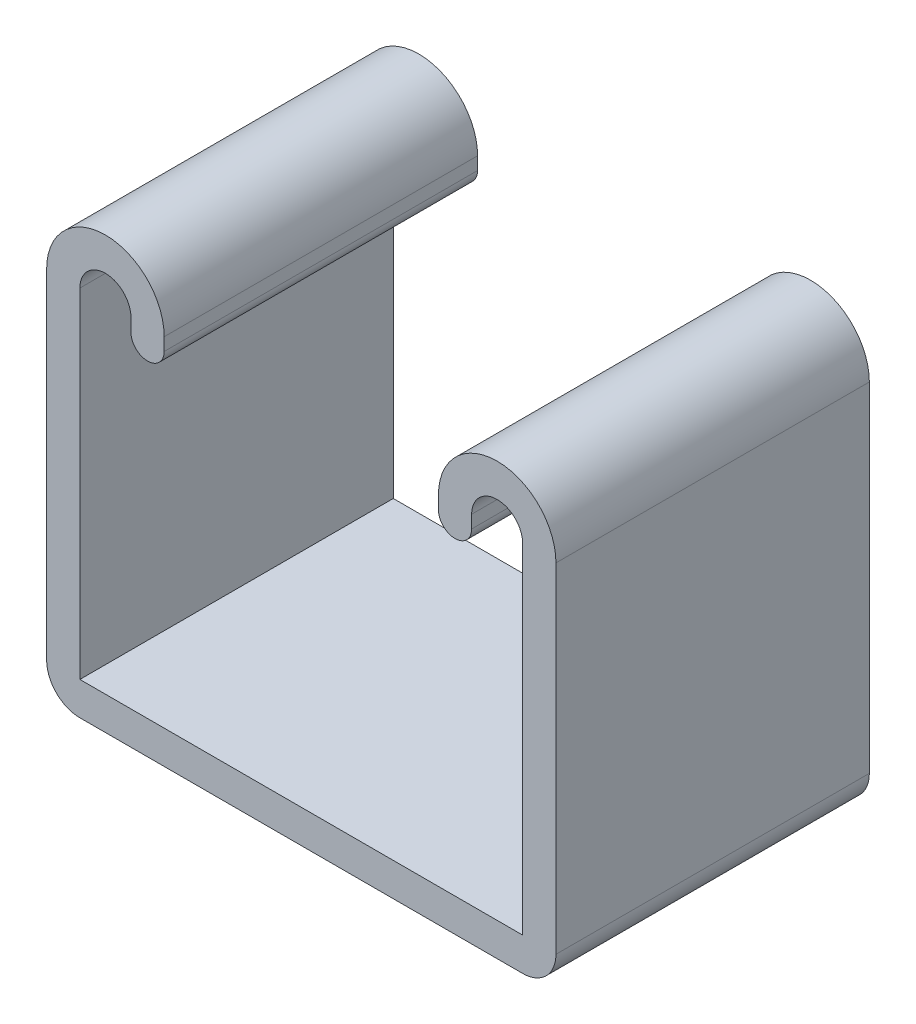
ISO-10303-21;
HEADER;
FILE_DESCRIPTION(('STEP AP214'),'2;1');
FILE_NAME('part.step','',(''),(''),'','','');
FILE_SCHEMA(('AUTOMOTIVE_DESIGN { 1 0 10303 214 1 1 1 1 }'));
ENDSEC;
DATA;
#1=APPLICATION_CONTEXT('core data for automotive mechanical design processes');
#2=APPLICATION_PROTOCOL_DEFINITION('international standard','automotive_design',2000,#1);
#3=PRODUCT_CONTEXT('',#1,'mechanical');
#4=PRODUCT('Part','Part','',(#3));
#5=PRODUCT_RELATED_PRODUCT_CATEGORY('part','',(#4));
#6=PRODUCT_DEFINITION_FORMATION('','',#4);
#7=PRODUCT_DEFINITION_CONTEXT('part definition',#1,'design');
#8=PRODUCT_DEFINITION('design','',#6,#7);
#9=PRODUCT_DEFINITION_SHAPE('','',#8);
#10=(LENGTH_UNIT() NAMED_UNIT(*) SI_UNIT(.MILLI.,.METRE.));
#11=(NAMED_UNIT(*) PLANE_ANGLE_UNIT() SI_UNIT($,.RADIAN.));
#12=(NAMED_UNIT(*) SI_UNIT($,.STERADIAN.) SOLID_ANGLE_UNIT());
#13=UNCERTAINTY_MEASURE_WITH_UNIT(LENGTH_MEASURE(1.E-05),#10,'distance_accuracy_value','');
#14=(GEOMETRIC_REPRESENTATION_CONTEXT(3) GLOBAL_UNCERTAINTY_ASSIGNED_CONTEXT((#13)) GLOBAL_UNIT_ASSIGNED_CONTEXT((#10,
#11,#12)) REPRESENTATION_CONTEXT('',''));
#15=CARTESIAN_POINT('',(0.,0.,0.));
#16=DIRECTION('',(0.,0.,1.));
#17=DIRECTION('',(1.,0.,0.));
#18=AXIS2_PLACEMENT_3D('',#15,#16,#17);
#19=CARTESIAN_POINT('',(-15.875,15.1511,12.7));
#20=DIRECTION('',(0.,0.,-1.));
#21=DIRECTION('',(-1.,0.,0.));
#22=AXIS2_PLACEMENT_3D('',#19,#20,#21);
#23=CYLINDRICAL_SURFACE('',#22,4.7625);
#24=CARTESIAN_POINT('',(-15.875,15.1511,-12.7));
#25=DIRECTION('',(0.,0.,1.));
#26=DIRECTION('',(-1.,0.,0.));
#27=AXIS2_PLACEMENT_3D('',#24,#25,#26);
#28=CIRCLE('',#27,4.7625);
#29=CARTESIAN_POINT('',(-11.1125,15.1511,-12.7));
#30=VERTEX_POINT('',#29);
#31=CARTESIAN_POINT('',(-20.6375,15.1511,-12.7));
#32=VERTEX_POINT('',#31);
#33=EDGE_CURVE('E195',#30,#32,#28,.T.);
#34=ORIENTED_EDGE('',*,*,#33,.T.);
#35=DIRECTION('',(0.,0.,-1.));
#36=VECTOR('',#35,1.);
#37=CARTESIAN_POINT('',(-20.6375,15.1511,12.7));
#38=LINE('',#37,#36);
#39=CARTESIAN_POINT('',(-20.6375,15.1511,12.7));
#40=VERTEX_POINT('',#39);
#41=EDGE_CURVE('E11',#40,#32,#38,.T.);
#42=ORIENTED_EDGE('',*,*,#41,.F.);
#43=CARTESIAN_POINT('',(-15.875,15.1511,12.7));
#44=DIRECTION('',(0.,0.,1.));
#45=DIRECTION('',(-1.,0.,0.));
#46=AXIS2_PLACEMENT_3D('',#43,#44,#45);
#47=CIRCLE('',#46,4.7625);
#48=CARTESIAN_POINT('',(-11.1125,15.1511,12.7));
#49=VERTEX_POINT('',#48);
#50=EDGE_CURVE('E229',#49,#40,#47,.T.);
#51=ORIENTED_EDGE('',*,*,#50,.F.);
#52=DIRECTION('',(0.,0.,-1.));
#53=VECTOR('',#52,1.);
#54=CARTESIAN_POINT('',(-11.1125,15.1511,12.7));
#55=LINE('',#54,#53);
#56=EDGE_CURVE('E191',#49,#30,#55,.T.);
#57=ORIENTED_EDGE('',*,*,#56,.T.);
#58=EDGE_LOOP('',(#34,#42,#51,#57));
#59=FACE_BOUND('',#58,.T.);
#60=ADVANCED_FACE('F39',(#59),#23,.T.);
#61=CARTESIAN_POINT('',(-20.6375,15.1511,12.7));
#62=DIRECTION('',(1.,0.,0.));
#63=DIRECTION('',(0.,1.,0.));
#64=AXIS2_PLACEMENT_3D('',#61,#62,#63);
#65=PLANE('',#64);
#66=DIRECTION('',(0.,-1.,0.));
#67=VECTOR('',#66,1.);
#68=CARTESIAN_POINT('',(-20.6375,15.1511,-12.7));
#69=LINE('',#68,#67);
#70=CARTESIAN_POINT('',(-20.6375,-12.319,-12.7));
#71=VERTEX_POINT('',#70);
#72=EDGE_CURVE('E198',#32,#71,#69,.T.);
#73=ORIENTED_EDGE('',*,*,#72,.T.);
#74=DIRECTION('',(0.,0.,-1.));
#75=VECTOR('',#74,1.);
#76=CARTESIAN_POINT('',(-20.6375,-12.319,12.7));
#77=LINE('',#76,#75);
#78=CARTESIAN_POINT('',(-20.6375,-12.319,12.7));
#79=VERTEX_POINT('',#78);
#80=EDGE_CURVE('E47',#79,#71,#77,.T.);
#81=ORIENTED_EDGE('',*,*,#80,.F.);
#82=DIRECTION('',(0.,-1.,0.));
#83=VECTOR('',#82,1.);
#84=CARTESIAN_POINT('',(-20.6375,15.1511,12.7));
#85=LINE('',#84,#83);
#86=EDGE_CURVE('E128',#40,#79,#85,.T.);
#87=ORIENTED_EDGE('',*,*,#86,.F.);
#88=ORIENTED_EDGE('',*,*,#41,.T.);
#89=EDGE_LOOP('',(#73,#81,#87,#88));
#90=FACE_BOUND('',#89,.T.);
#91=ADVANCED_FACE('F337',(#90),#65,.F.);
#92=CARTESIAN_POINT('',(-17.9451,-12.319,12.7));
#93=DIRECTION('',(0.,0.,-1.));
#94=DIRECTION('',(-1.,0.,0.));
#95=AXIS2_PLACEMENT_3D('',#92,#93,#94);
#96=CYLINDRICAL_SURFACE('',#95,2.6924);
#97=CARTESIAN_POINT('',(-17.9451,-12.319,-12.7));
#98=DIRECTION('',(0.,0.,1.));
#99=DIRECTION('',(-1.,0.,0.));
#100=AXIS2_PLACEMENT_3D('',#97,#98,#99);
#101=CIRCLE('',#100,2.6924);
#102=CARTESIAN_POINT('',(-17.9451,-15.0114,-12.7));
#103=VERTEX_POINT('',#102);
#104=EDGE_CURVE('E200',#71,#103,#101,.T.);
#105=ORIENTED_EDGE('',*,*,#104,.T.);
#106=DIRECTION('',(0.,0.,-1.));
#107=VECTOR('',#106,1.);
#108=CARTESIAN_POINT('',(-17.9451,-15.0114,12.7));
#109=LINE('',#108,#107);
#110=CARTESIAN_POINT('',(-17.9451,-15.0114,12.7));
#111=VERTEX_POINT('',#110);
#112=EDGE_CURVE('E266',#111,#103,#109,.T.);
#113=ORIENTED_EDGE('',*,*,#112,.F.);
#114=CARTESIAN_POINT('',(-17.9451,-12.319,12.7));
#115=DIRECTION('',(0.,0.,1.));
#116=DIRECTION('',(-1.,0.,0.));
#117=AXIS2_PLACEMENT_3D('',#114,#115,#116);
#118=CIRCLE('',#117,2.6924);
#119=EDGE_CURVE('E274',#79,#111,#118,.T.);
#120=ORIENTED_EDGE('',*,*,#119,.F.);
#121=ORIENTED_EDGE('',*,*,#80,.T.);
#122=EDGE_LOOP('',(#105,#113,#120,#121));
#123=FACE_BOUND('',#122,.T.);
#124=ADVANCED_FACE('F272',(#123),#96,.T.);
#125=CARTESIAN_POINT('',(-17.9451,-15.0114,12.7));
#126=DIRECTION('',(0.,1.,0.));
#127=DIRECTION('',(-1.,0.,0.));
#128=AXIS2_PLACEMENT_3D('',#125,#126,#127);
#129=PLANE('',#128);
#130=DIRECTION('',(1.,0.,0.));
#131=VECTOR('',#130,1.);
#132=CARTESIAN_POINT('',(-17.9451,-15.0114,-12.7));
#133=LINE('',#132,#131);
#134=CARTESIAN_POINT('',(17.9451,-15.0114,-12.7));
#135=VERTEX_POINT('',#134);
#136=EDGE_CURVE('E202',#103,#135,#133,.T.);
#137=ORIENTED_EDGE('',*,*,#136,.T.);
#138=DIRECTION('',(0.,0.,-1.));
#139=VECTOR('',#138,1.);
#140=CARTESIAN_POINT('',(17.9451,-15.0114,12.7));
#141=LINE('',#140,#139);
#142=CARTESIAN_POINT('',(17.9451,-15.0114,12.7));
#143=VERTEX_POINT('',#142);
#144=EDGE_CURVE('E263',#143,#135,#141,.T.);
#145=ORIENTED_EDGE('',*,*,#144,.F.);
#146=DIRECTION('',(1.,0.,0.));
#147=VECTOR('',#146,1.);
#148=CARTESIAN_POINT('',(-17.9451,-15.0114,12.7));
#149=LINE('',#148,#147);
#150=EDGE_CURVE('E292',#111,#143,#149,.T.);
#151=ORIENTED_EDGE('',*,*,#150,.F.);
#152=ORIENTED_EDGE('',*,*,#112,.T.);
#153=EDGE_LOOP('',(#137,#145,#151,#152));
#154=FACE_BOUND('',#153,.T.);
#155=ADVANCED_FACE('F283',(#154),#129,.F.);
#156=CARTESIAN_POINT('',(17.9451,-12.319,12.7));
#157=DIRECTION('',(0.,0.,-1.));
#158=DIRECTION('',(-1.,0.,0.));
#159=AXIS2_PLACEMENT_3D('',#156,#157,#158);
#160=CYLINDRICAL_SURFACE('',#159,2.6924);
#161=CARTESIAN_POINT('',(17.9451,-12.319,-12.7));
#162=DIRECTION('',(0.,0.,1.));
#163=DIRECTION('',(1.,0.,0.));
#164=AXIS2_PLACEMENT_3D('',#161,#162,#163);
#165=CIRCLE('',#164,2.6924);
#166=CARTESIAN_POINT('',(20.6375,-12.319,-12.7));
#167=VERTEX_POINT('',#166);
#168=EDGE_CURVE('E204',#135,#167,#165,.T.);
#169=ORIENTED_EDGE('',*,*,#168,.T.);
#170=DIRECTION('',(0.,0.,-1.));
#171=VECTOR('',#170,1.);
#172=CARTESIAN_POINT('',(20.6375,-12.319,12.7));
#173=LINE('',#172,#171);
#174=CARTESIAN_POINT('',(20.6375,-12.319,12.7));
#175=VERTEX_POINT('',#174);
#176=EDGE_CURVE('E260',#175,#167,#173,.T.);
#177=ORIENTED_EDGE('',*,*,#176,.F.);
#178=CARTESIAN_POINT('',(17.9451,-12.319,12.7));
#179=DIRECTION('',(0.,0.,1.));
#180=DIRECTION('',(1.,0.,0.));
#181=AXIS2_PLACEMENT_3D('',#178,#179,#180);
#182=CIRCLE('',#181,2.6924);
#183=EDGE_CURVE('E289',#143,#175,#182,.T.);
#184=ORIENTED_EDGE('',*,*,#183,.F.);
#185=ORIENTED_EDGE('',*,*,#144,.T.);
#186=EDGE_LOOP('',(#169,#177,#184,#185));
#187=FACE_BOUND('',#186,.T.);
#188=ADVANCED_FACE('F287',(#187),#160,.T.);
#189=CARTESIAN_POINT('',(20.6375,-12.319,12.7));
#190=DIRECTION('',(-1.,0.,0.));
#191=DIRECTION('',(0.,0.,1.));
#192=AXIS2_PLACEMENT_3D('',#189,#190,#191);
#193=PLANE('',#192);
#194=DIRECTION('',(0.,1.,0.));
#195=VECTOR('',#194,1.);
#196=CARTESIAN_POINT('',(20.6375,-12.319,-12.7));
#197=LINE('',#196,#195);
#198=CARTESIAN_POINT('',(20.6375,15.1511,-12.7));
#199=VERTEX_POINT('',#198);
#200=EDGE_CURVE('E206',#167,#199,#197,.T.);
#201=ORIENTED_EDGE('',*,*,#200,.T.);
#202=DIRECTION('',(0.,0.,-1.));
#203=VECTOR('',#202,1.);
#204=CARTESIAN_POINT('',(20.6375,15.1511,12.7));
#205=LINE('',#204,#203);
#206=CARTESIAN_POINT('',(20.6375,15.1511,12.7));
#207=VERTEX_POINT('',#206);
#208=EDGE_CURVE('E257',#207,#199,#205,.T.);
#209=ORIENTED_EDGE('',*,*,#208,.F.);
#210=DIRECTION('',(0.,1.,0.));
#211=VECTOR('',#210,1.);
#212=CARTESIAN_POINT('',(20.6375,-12.319,12.7));
#213=LINE('',#212,#211);
#214=EDGE_CURVE('E291',#175,#207,#213,.T.);
#215=ORIENTED_EDGE('',*,*,#214,.F.);
#216=ORIENTED_EDGE('',*,*,#176,.T.);
#217=EDGE_LOOP('',(#201,#209,#215,#216));
#218=FACE_BOUND('',#217,.T.);
#219=ADVANCED_FACE('F350',(#218),#193,.F.);
#220=CARTESIAN_POINT('',(15.875,15.1511,12.7));
#221=DIRECTION('',(0.,0.,-1.));
#222=DIRECTION('',(-1.,0.,0.));
#223=AXIS2_PLACEMENT_3D('',#220,#221,#222);
#224=CYLINDRICAL_SURFACE('',#223,4.7625);
#225=CARTESIAN_POINT('',(15.875,15.1511,-12.7));
#226=DIRECTION('',(0.,0.,1.));
#227=DIRECTION('',(1.,0.,0.));
#228=AXIS2_PLACEMENT_3D('',#225,#226,#227);
#229=CIRCLE('',#228,4.7625);
#230=CARTESIAN_POINT('',(11.1125,15.1511,-12.7));
#231=VERTEX_POINT('',#230);
#232=EDGE_CURVE('E208',#199,#231,#229,.T.);
#233=ORIENTED_EDGE('',*,*,#232,.T.);
#234=DIRECTION('',(0.,0.,-1.));
#235=VECTOR('',#234,1.);
#236=CARTESIAN_POINT('',(11.1125,15.1511,12.7));
#237=LINE('',#236,#235);
#238=CARTESIAN_POINT('',(11.1125,15.1511,12.7));
#239=VERTEX_POINT('',#238);
#240=EDGE_CURVE('E254',#239,#231,#237,.T.);
#241=ORIENTED_EDGE('',*,*,#240,.F.);
#242=CARTESIAN_POINT('',(15.875,15.1511,12.7));
#243=DIRECTION('',(0.,0.,1.));
#244=DIRECTION('',(1.,0.,0.));
#245=AXIS2_PLACEMENT_3D('',#242,#243,#244);
#246=CIRCLE('',#245,4.7625);
#247=EDGE_CURVE('E294',#207,#239,#246,.T.);
#248=ORIENTED_EDGE('',*,*,#247,.F.);
#249=ORIENTED_EDGE('',*,*,#208,.T.);
#250=EDGE_LOOP('',(#233,#241,#248,#249));
#251=FACE_BOUND('',#250,.T.);
#252=ADVANCED_FACE('F353',(#251),#224,.T.);
#253=CARTESIAN_POINT('',(11.1125,15.1511,12.7));
#254=DIRECTION('',(1.,0.,0.));
#255=DIRECTION('',(0.,1.,0.));
#256=AXIS2_PLACEMENT_3D('',#253,#254,#255);
#257=PLANE('',#256);
#258=DIRECTION('',(0.,-1.,0.));
#259=VECTOR('',#258,1.);
#260=CARTESIAN_POINT('',(11.1125,15.1511,-12.7));
#261=LINE('',#260,#259);
#262=CARTESIAN_POINT('',(11.1125,14.11605,-12.7));
#263=VERTEX_POINT('',#262);
#264=EDGE_CURVE('E210',#231,#263,#261,.T.);
#265=ORIENTED_EDGE('',*,*,#264,.T.);
#266=DIRECTION('',(0.,0.,-1.));
#267=VECTOR('',#266,1.);
#268=CARTESIAN_POINT('',(11.1125,14.11605,12.7));
#269=LINE('',#268,#267);
#270=CARTESIAN_POINT('',(11.1125,14.11605,12.7));
#271=VERTEX_POINT('',#270);
#272=EDGE_CURVE('E251',#271,#263,#269,.T.);
#273=ORIENTED_EDGE('',*,*,#272,.F.);
#274=DIRECTION('',(0.,-1.,0.));
#275=VECTOR('',#274,1.);
#276=CARTESIAN_POINT('',(11.1125,15.1511,12.7));
#277=LINE('',#276,#275);
#278=EDGE_CURVE('E300',#239,#271,#277,.T.);
#279=ORIENTED_EDGE('',*,*,#278,.F.);
#280=ORIENTED_EDGE('',*,*,#240,.T.);
#281=EDGE_LOOP('',(#265,#273,#279,#280));
#282=FACE_BOUND('',#281,.T.);
#283=ADVANCED_FACE('F357',(#282),#257,.F.);
#284=CARTESIAN_POINT('',(12.4587,14.11605,12.7));
#285=DIRECTION('',(0.,0.,-1.));
#286=DIRECTION('',(-1.,0.,0.));
#287=AXIS2_PLACEMENT_3D('',#284,#285,#286);
#288=CYLINDRICAL_SURFACE('',#287,1.3462);
#289=CARTESIAN_POINT('',(12.4587,14.11605,-12.7));
#290=DIRECTION('',(0.,0.,1.));
#291=DIRECTION('',(1.,0.,0.));
#292=AXIS2_PLACEMENT_3D('',#289,#290,#291);
#293=CIRCLE('',#292,1.3462);
#294=CARTESIAN_POINT('',(13.8049,14.11605,-12.7));
#295=VERTEX_POINT('',#294);
#296=EDGE_CURVE('E212',#263,#295,#293,.T.);
#297=ORIENTED_EDGE('',*,*,#296,.T.);
#298=DIRECTION('',(0.,0.,-1.));
#299=VECTOR('',#298,1.);
#300=CARTESIAN_POINT('',(13.8049,14.11605,12.7));
#301=LINE('',#300,#299);
#302=CARTESIAN_POINT('',(13.8049,14.11605,12.7));
#303=VERTEX_POINT('',#302);
#304=EDGE_CURVE('E248',#303,#295,#301,.T.);
#305=ORIENTED_EDGE('',*,*,#304,.F.);
#306=CARTESIAN_POINT('',(12.4587,14.11605,12.7));
#307=DIRECTION('',(0.,0.,1.));
#308=DIRECTION('',(1.,0.,0.));
#309=AXIS2_PLACEMENT_3D('',#306,#307,#308);
#310=CIRCLE('',#309,1.3462);
#311=EDGE_CURVE('E302',#271,#303,#310,.T.);
#312=ORIENTED_EDGE('',*,*,#311,.F.);
#313=ORIENTED_EDGE('',*,*,#272,.T.);
#314=EDGE_LOOP('',(#297,#305,#312,#313));
#315=FACE_BOUND('',#314,.T.);
#316=ADVANCED_FACE('F361',(#315),#288,.T.);
#317=CARTESIAN_POINT('',(13.8049,15.1511,12.7));
#318=DIRECTION('',(-1.,0.,0.));
#319=DIRECTION('',(0.,0.,1.));
#320=AXIS2_PLACEMENT_3D('',#317,#318,#319);
#321=PLANE('',#320);
#322=DIRECTION('',(0.,1.,0.));
#323=VECTOR('',#322,1.);
#324=CARTESIAN_POINT('',(13.8049,15.1511,-12.7));
#325=LINE('',#324,#323);
#326=CARTESIAN_POINT('',(13.8049,15.1511,-12.7));
#327=VERTEX_POINT('',#326);
#328=EDGE_CURVE('E214',#295,#327,#325,.T.);
#329=ORIENTED_EDGE('',*,*,#328,.T.);
#330=DIRECTION('',(0.,0.,-1.));
#331=VECTOR('',#330,1.);
#332=CARTESIAN_POINT('',(13.8049,15.1511,12.7));
#333=LINE('',#332,#331);
#334=CARTESIAN_POINT('',(13.8049,15.1511,12.7));
#335=VERTEX_POINT('',#334);
#336=EDGE_CURVE('E245',#335,#327,#333,.T.);
#337=ORIENTED_EDGE('',*,*,#336,.F.);
#338=DIRECTION('',(0.,1.,0.));
#339=VECTOR('',#338,1.);
#340=CARTESIAN_POINT('',(13.8049,15.1511,12.7));
#341=LINE('',#340,#339);
#342=EDGE_CURVE('E304',#303,#335,#341,.T.);
#343=ORIENTED_EDGE('',*,*,#342,.F.);
#344=ORIENTED_EDGE('',*,*,#304,.T.);
#345=EDGE_LOOP('',(#329,#337,#343,#344));
#346=FACE_BOUND('',#345,.T.);
#347=ADVANCED_FACE('F365',(#346),#321,.F.);
#348=CARTESIAN_POINT('',(15.875,15.1511,12.7));
#349=DIRECTION('',(0.,0.,-1.));
#350=DIRECTION('',(-1.,0.,0.));
#351=AXIS2_PLACEMENT_3D('',#348,#349,#350);
#352=CYLINDRICAL_SURFACE('',#351,2.0701);
#353=CARTESIAN_POINT('',(15.875,15.1511,-12.7));
#354=DIRECTION('',(0.,0.,-1.));
#355=DIRECTION('',(1.,0.,0.));
#356=AXIS2_PLACEMENT_3D('',#353,#354,#355);
#357=CIRCLE('',#356,2.0701);
#358=CARTESIAN_POINT('',(17.9451,15.1511,-12.7));
#359=VERTEX_POINT('',#358);
#360=EDGE_CURVE('E216',#327,#359,#357,.T.);
#361=ORIENTED_EDGE('',*,*,#360,.T.);
#362=DIRECTION('',(0.,0.,-1.));
#363=VECTOR('',#362,1.);
#364=CARTESIAN_POINT('',(17.9451,15.1511,12.7));
#365=LINE('',#364,#363);
#366=CARTESIAN_POINT('',(17.9451,15.1511,12.7));
#367=VERTEX_POINT('',#366);
#368=EDGE_CURVE('E242',#367,#359,#365,.T.);
#369=ORIENTED_EDGE('',*,*,#368,.F.);
#370=CARTESIAN_POINT('',(15.875,15.1511,12.7));
#371=DIRECTION('',(0.,0.,-1.));
#372=DIRECTION('',(1.,0.,0.));
#373=AXIS2_PLACEMENT_3D('',#370,#371,#372);
#374=CIRCLE('',#373,2.0701);
#375=EDGE_CURVE('E306',#335,#367,#374,.T.);
#376=ORIENTED_EDGE('',*,*,#375,.F.);
#377=ORIENTED_EDGE('',*,*,#336,.T.);
#378=EDGE_LOOP('',(#361,#369,#376,#377));
#379=FACE_BOUND('',#378,.T.);
#380=ADVANCED_FACE('F369',(#379),#352,.F.);
#381=CARTESIAN_POINT('',(17.9451,-12.319,12.7));
#382=DIRECTION('',(1.,0.,0.));
#383=DIRECTION('',(0.,1.,0.));
#384=AXIS2_PLACEMENT_3D('',#381,#382,#383);
#385=PLANE('',#384);
#386=DIRECTION('',(0.,-1.,0.));
#387=VECTOR('',#386,1.);
#388=CARTESIAN_POINT('',(17.9451,-12.319,-12.7));
#389=LINE('',#388,#387);
#390=CARTESIAN_POINT('',(17.9451,-12.319,-12.7));
#391=VERTEX_POINT('',#390);
#392=EDGE_CURVE('E218',#359,#391,#389,.T.);
#393=ORIENTED_EDGE('',*,*,#392,.T.);
#394=DIRECTION('',(0.,0.,-1.));
#395=VECTOR('',#394,1.);
#396=CARTESIAN_POINT('',(17.9451,-12.319,12.7));
#397=LINE('',#396,#395);
#398=CARTESIAN_POINT('',(17.9451,-12.319,12.7));
#399=VERTEX_POINT('',#398);
#400=EDGE_CURVE('E239',#399,#391,#397,.T.);
#401=ORIENTED_EDGE('',*,*,#400,.F.);
#402=DIRECTION('',(0.,-1.,0.));
#403=VECTOR('',#402,1.);
#404=CARTESIAN_POINT('',(17.9451,-12.319,12.7));
#405=LINE('',#404,#403);
#406=EDGE_CURVE('E308',#367,#399,#405,.T.);
#407=ORIENTED_EDGE('',*,*,#406,.F.);
#408=ORIENTED_EDGE('',*,*,#368,.T.);
#409=EDGE_LOOP('',(#393,#401,#407,#408));
#410=FACE_BOUND('',#409,.T.);
#411=ADVANCED_FACE('F373',(#410),#385,.F.);
#412=CARTESIAN_POINT('',(-17.9451,-12.319,12.7));
#413=DIRECTION('',(0.,-1.,0.));
#414=DIRECTION('',(0.,0.,-1.));
#415=AXIS2_PLACEMENT_3D('',#412,#413,#414);
#416=PLANE('',#415);
#417=DIRECTION('',(-1.,0.,0.));
#418=VECTOR('',#417,1.);
#419=CARTESIAN_POINT('',(-17.9451,-12.319,-12.7));
#420=LINE('',#419,#418);
#421=CARTESIAN_POINT('',(-17.9451,-12.319,-12.7));
#422=VERTEX_POINT('',#421);
#423=EDGE_CURVE('E220',#391,#422,#420,.T.);
#424=ORIENTED_EDGE('',*,*,#423,.T.);
#425=DIRECTION('',(0.,0.,-1.));
#426=VECTOR('',#425,1.);
#427=CARTESIAN_POINT('',(-17.9451,-12.319,12.7));
#428=LINE('',#427,#426);
#429=CARTESIAN_POINT('',(-17.9451,-12.319,12.7));
#430=VERTEX_POINT('',#429);
#431=EDGE_CURVE('E236',#430,#422,#428,.T.);
#432=ORIENTED_EDGE('',*,*,#431,.F.);
#433=DIRECTION('',(-1.,0.,0.));
#434=VECTOR('',#433,1.);
#435=CARTESIAN_POINT('',(-17.9451,-12.319,12.7));
#436=LINE('',#435,#434);
#437=EDGE_CURVE('E310',#399,#430,#436,.T.);
#438=ORIENTED_EDGE('',*,*,#437,.F.);
#439=ORIENTED_EDGE('',*,*,#400,.T.);
#440=EDGE_LOOP('',(#424,#432,#438,#439));
#441=FACE_BOUND('',#440,.T.);
#442=ADVANCED_FACE('F377',(#441),#416,.F.);
#443=CARTESIAN_POINT('',(-17.9451,15.1511,12.7));
#444=DIRECTION('',(-1.,0.,0.));
#445=DIRECTION('',(0.,0.,1.));
#446=AXIS2_PLACEMENT_3D('',#443,#444,#445);
#447=PLANE('',#446);
#448=DIRECTION('',(0.,1.,0.));
#449=VECTOR('',#448,1.);
#450=CARTESIAN_POINT('',(-17.9451,15.1511,-12.7));
#451=LINE('',#450,#449);
#452=CARTESIAN_POINT('',(-17.9451,15.1511,-12.7));
#453=VERTEX_POINT('',#452);
#454=EDGE_CURVE('E222',#422,#453,#451,.T.);
#455=ORIENTED_EDGE('',*,*,#454,.T.);
#456=DIRECTION('',(0.,0.,-1.));
#457=VECTOR('',#456,1.);
#458=CARTESIAN_POINT('',(-17.9451,15.1511,12.7));
#459=LINE('',#458,#457);
#460=CARTESIAN_POINT('',(-17.9451,15.1511,12.7));
#461=VERTEX_POINT('',#460);
#462=EDGE_CURVE('E233',#461,#453,#459,.T.);
#463=ORIENTED_EDGE('',*,*,#462,.F.);
#464=DIRECTION('',(0.,1.,0.));
#465=VECTOR('',#464,1.);
#466=CARTESIAN_POINT('',(-17.9451,15.1511,12.7));
#467=LINE('',#466,#465);
#468=EDGE_CURVE('E312',#430,#461,#467,.T.);
#469=ORIENTED_EDGE('',*,*,#468,.F.);
#470=ORIENTED_EDGE('',*,*,#431,.T.);
#471=EDGE_LOOP('',(#455,#463,#469,#470));
#472=FACE_BOUND('',#471,.T.);
#473=ADVANCED_FACE('F318',(#472),#447,.F.);
#474=CARTESIAN_POINT('',(-15.875,15.1511,12.7));
#475=DIRECTION('',(0.,0.,-1.));
#476=DIRECTION('',(-1.,0.,0.));
#477=AXIS2_PLACEMENT_3D('',#474,#475,#476);
#478=CYLINDRICAL_SURFACE('',#477,2.0701);
#479=CARTESIAN_POINT('',(-15.875,15.1511,-12.7));
#480=DIRECTION('',(0.,0.,-1.));
#481=DIRECTION('',(-1.,0.,0.));
#482=AXIS2_PLACEMENT_3D('',#479,#480,#481);
#483=CIRCLE('',#482,2.0701);
#484=CARTESIAN_POINT('',(-13.8049,15.1511,-12.7));
#485=VERTEX_POINT('',#484);
#486=EDGE_CURVE('E224',#453,#485,#483,.T.);
#487=ORIENTED_EDGE('',*,*,#486,.T.);
#488=DIRECTION('',(0.,0.,-1.));
#489=VECTOR('',#488,1.);
#490=CARTESIAN_POINT('',(-13.8049,15.1511,12.7));
#491=LINE('',#490,#489);
#492=CARTESIAN_POINT('',(-13.8049,15.1511,12.7));
#493=VERTEX_POINT('',#492);
#494=EDGE_CURVE('E186',#493,#485,#491,.T.);
#495=ORIENTED_EDGE('',*,*,#494,.F.);
#496=CARTESIAN_POINT('',(-15.875,15.1511,12.7));
#497=DIRECTION('',(0.,0.,-1.));
#498=DIRECTION('',(-1.,0.,0.));
#499=AXIS2_PLACEMENT_3D('',#496,#497,#498);
#500=CIRCLE('',#499,2.0701);
#501=EDGE_CURVE('E177',#461,#493,#500,.T.);
#502=ORIENTED_EDGE('',*,*,#501,.F.);
#503=ORIENTED_EDGE('',*,*,#462,.T.);
#504=EDGE_LOOP('',(#487,#495,#502,#503));
#505=FACE_BOUND('',#504,.T.);
#506=ADVANCED_FACE('F322',(#505),#478,.F.);
#507=CARTESIAN_POINT('',(-13.8049,15.1511,12.7));
#508=DIRECTION('',(1.,0.,0.));
#509=DIRECTION('',(0.,1.,0.));
#510=AXIS2_PLACEMENT_3D('',#507,#508,#509);
#511=PLANE('',#510);
#512=DIRECTION('',(0.,-1.,0.));
#513=VECTOR('',#512,1.);
#514=CARTESIAN_POINT('',(-13.8049,15.1511,-12.7));
#515=LINE('',#514,#513);
#516=CARTESIAN_POINT('',(-13.8049,14.11605,-12.7));
#517=VERTEX_POINT('',#516);
#518=EDGE_CURVE('E185',#485,#517,#515,.T.);
#519=ORIENTED_EDGE('',*,*,#518,.T.);
#520=DIRECTION('',(0.,0.,-1.));
#521=VECTOR('',#520,1.);
#522=CARTESIAN_POINT('',(-13.8049,14.11605,12.7));
#523=LINE('',#522,#521);
#524=CARTESIAN_POINT('',(-13.8049,14.11605,12.7));
#525=VERTEX_POINT('',#524);
#526=EDGE_CURVE('E182',#525,#517,#523,.T.);
#527=ORIENTED_EDGE('',*,*,#526,.F.);
#528=DIRECTION('',(0.,-1.,0.));
#529=VECTOR('',#528,1.);
#530=CARTESIAN_POINT('',(-13.8049,15.1511,12.7));
#531=LINE('',#530,#529);
#532=EDGE_CURVE('E171',#493,#525,#531,.T.);
#533=ORIENTED_EDGE('',*,*,#532,.F.);
#534=ORIENTED_EDGE('',*,*,#494,.T.);
#535=EDGE_LOOP('',(#519,#527,#533,#534));
#536=FACE_BOUND('',#535,.T.);
#537=ADVANCED_FACE('F183',(#536),#511,.F.);
#538=CARTESIAN_POINT('',(-12.4587,14.11605,12.7));
#539=DIRECTION('',(0.,0.,-1.));
#540=DIRECTION('',(-1.,0.,0.));
#541=AXIS2_PLACEMENT_3D('',#538,#539,#540);
#542=CYLINDRICAL_SURFACE('',#541,1.3462);
#543=CARTESIAN_POINT('',(-12.4587,14.11605,-12.7));
#544=DIRECTION('',(0.,0.,1.));
#545=DIRECTION('',(-1.,0.,0.));
#546=AXIS2_PLACEMENT_3D('',#543,#544,#545);
#547=CIRCLE('',#546,1.3462);
#548=CARTESIAN_POINT('',(-11.1125,14.11605,-12.7));
#549=VERTEX_POINT('',#548);
#550=EDGE_CURVE('E114',#517,#549,#547,.T.);
#551=ORIENTED_EDGE('',*,*,#550,.T.);
#552=DIRECTION('',(0.,0.,-1.));
#553=VECTOR('',#552,1.);
#554=CARTESIAN_POINT('',(-11.1125,14.11605,12.7));
#555=LINE('',#554,#553);
#556=CARTESIAN_POINT('',(-11.1125,14.11605,12.7));
#557=VERTEX_POINT('',#556);
#558=EDGE_CURVE('E187',#557,#549,#555,.T.);
#559=ORIENTED_EDGE('',*,*,#558,.F.);
#560=CARTESIAN_POINT('',(-12.4587,14.11605,12.7));
#561=DIRECTION('',(0.,0.,1.));
#562=DIRECTION('',(-1.,0.,0.));
#563=AXIS2_PLACEMENT_3D('',#560,#561,#562);
#564=CIRCLE('',#563,1.3462);
#565=EDGE_CURVE('E175',#525,#557,#564,.T.);
#566=ORIENTED_EDGE('',*,*,#565,.F.);
#567=ORIENTED_EDGE('',*,*,#526,.T.);
#568=EDGE_LOOP('',(#551,#559,#566,#567));
#569=FACE_BOUND('',#568,.T.);
#570=ADVANCED_FACE('F189',(#569),#542,.T.);
#571=CARTESIAN_POINT('',(-11.1125,15.1511,12.7));
#572=DIRECTION('',(-1.,0.,0.));
#573=DIRECTION('',(0.,0.,1.));
#574=AXIS2_PLACEMENT_3D('',#571,#572,#573);
#575=PLANE('',#574);
#576=DIRECTION('',(0.,1.,0.));
#577=VECTOR('',#576,1.);
#578=CARTESIAN_POINT('',(-11.1125,15.1511,-12.7));
#579=LINE('',#578,#577);
#580=EDGE_CURVE('E120',#549,#30,#579,.T.);
#581=ORIENTED_EDGE('',*,*,#580,.T.);
#582=ORIENTED_EDGE('',*,*,#56,.F.);
#583=DIRECTION('',(0.,1.,0.));
#584=VECTOR('',#583,1.);
#585=CARTESIAN_POINT('',(-11.1125,15.1511,12.7));
#586=LINE('',#585,#584);
#587=EDGE_CURVE('E55',#557,#49,#586,.T.);
#588=ORIENTED_EDGE('',*,*,#587,.F.);
#589=ORIENTED_EDGE('',*,*,#558,.T.);
#590=EDGE_LOOP('',(#581,#582,#588,#589));
#591=FACE_BOUND('',#590,.T.);
#592=ADVANCED_FACE('F326',(#591),#575,.F.);
#593=CARTESIAN_POINT('',(-15.875,15.1511,12.7));
#594=DIRECTION('',(0.,0.,-1.));
#595=DIRECTION('',(-1.,0.,0.));
#596=AXIS2_PLACEMENT_3D('',#593,#594,#595);
#597=PLANE('',#596);
#598=ORIENTED_EDGE('',*,*,#50,.T.);
#599=ORIENTED_EDGE('',*,*,#86,.T.);
#600=ORIENTED_EDGE('',*,*,#119,.T.);
#601=ORIENTED_EDGE('',*,*,#150,.T.);
#602=ORIENTED_EDGE('',*,*,#183,.T.);
#603=ORIENTED_EDGE('',*,*,#214,.T.);
#604=ORIENTED_EDGE('',*,*,#247,.T.);
#605=ORIENTED_EDGE('',*,*,#278,.T.);
#606=ORIENTED_EDGE('',*,*,#311,.T.);
#607=ORIENTED_EDGE('',*,*,#342,.T.);
#608=ORIENTED_EDGE('',*,*,#375,.T.);
#609=ORIENTED_EDGE('',*,*,#406,.T.);
#610=ORIENTED_EDGE('',*,*,#437,.T.);
#611=ORIENTED_EDGE('',*,*,#468,.T.);
#612=ORIENTED_EDGE('',*,*,#501,.T.);
#613=ORIENTED_EDGE('',*,*,#532,.T.);
#614=ORIENTED_EDGE('',*,*,#565,.T.);
#615=ORIENTED_EDGE('',*,*,#587,.T.);
#616=EDGE_LOOP('',(#598,#599,#600,#601,#602,#603,#604,#605,#606,#607,#608,#609,#610,#611,#612,
#613,#614,#615));
#617=FACE_BOUND('',#616,.T.);
#618=ADVANCED_FACE('F173',(#617),#597,.F.);
#619=CARTESIAN_POINT('',(-15.875,15.1511,-12.7));
#620=DIRECTION('',(0.,0.,-1.));
#621=DIRECTION('',(-1.,0.,0.));
#622=AXIS2_PLACEMENT_3D('',#619,#620,#621);
#623=PLANE('',#622);
#624=ORIENTED_EDGE('',*,*,#33,.F.);
#625=ORIENTED_EDGE('',*,*,#580,.F.);
#626=ORIENTED_EDGE('',*,*,#550,.F.);
#627=ORIENTED_EDGE('',*,*,#518,.F.);
#628=ORIENTED_EDGE('',*,*,#486,.F.);
#629=ORIENTED_EDGE('',*,*,#454,.F.);
#630=ORIENTED_EDGE('',*,*,#423,.F.);
#631=ORIENTED_EDGE('',*,*,#392,.F.);
#632=ORIENTED_EDGE('',*,*,#360,.F.);
#633=ORIENTED_EDGE('',*,*,#328,.F.);
#634=ORIENTED_EDGE('',*,*,#296,.F.);
#635=ORIENTED_EDGE('',*,*,#264,.F.);
#636=ORIENTED_EDGE('',*,*,#232,.F.);
#637=ORIENTED_EDGE('',*,*,#200,.F.);
#638=ORIENTED_EDGE('',*,*,#168,.F.);
#639=ORIENTED_EDGE('',*,*,#136,.F.);
#640=ORIENTED_EDGE('',*,*,#104,.F.);
#641=ORIENTED_EDGE('',*,*,#72,.F.);
#642=EDGE_LOOP('',(#624,#625,#626,#627,#628,#629,#630,#631,#632,#633,#634,#635,#636,#637,#638,
#639,#640,#641));
#643=FACE_BOUND('',#642,.T.);
#644=ADVANCED_FACE('F278',(#643),#623,.T.);
#645=CLOSED_SHELL('',(#60,#91,#124,#155,#188,#219,#252,#283,#316,#347,#380,#411,#442,#473,#506,
#537,#570,#592,#618,#644));
#646=MANIFOLD_SOLID_BREP('B2',#645);
#647=ADVANCED_BREP_SHAPE_REPRESENTATION('',(#18,#646),#14);
#648=SHAPE_DEFINITION_REPRESENTATION(#9,#647);
ENDSEC;
END-ISO-10303-21;
